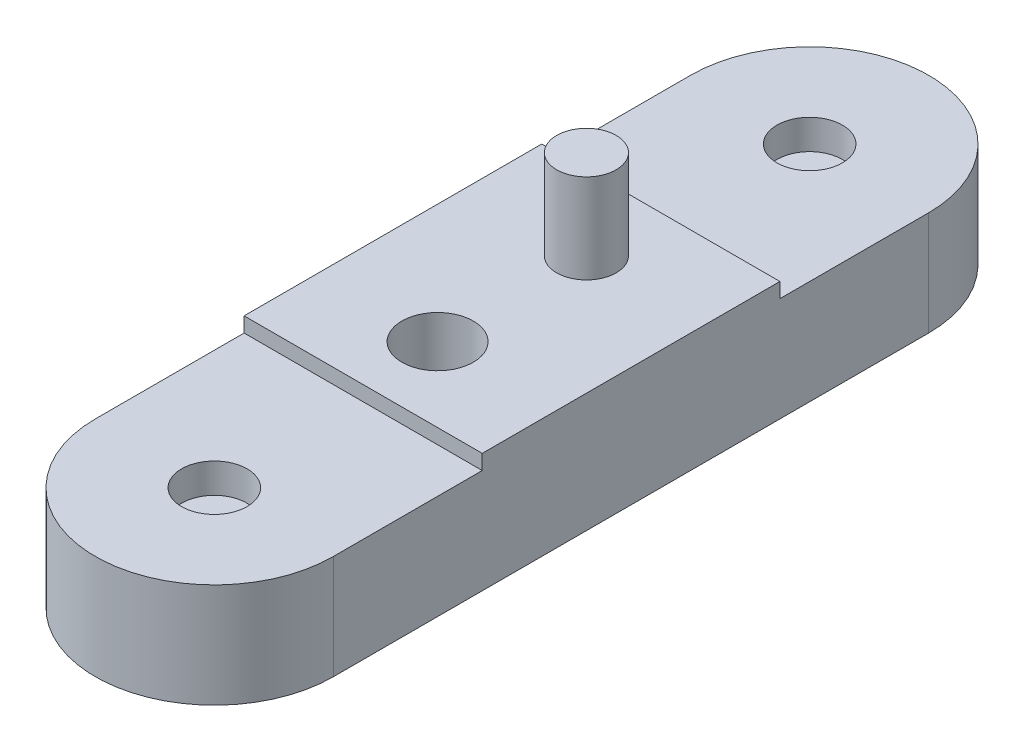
ISO-10303-21;
HEADER;
FILE_DESCRIPTION(('STEP AP214'),'2;1');
FILE_NAME('part.step','',(''),(''),'','','');
FILE_SCHEMA(('AUTOMOTIVE_DESIGN { 1 0 10303 214 1 1 1 1 }'));
ENDSEC;
DATA;
#1=APPLICATION_CONTEXT('core data for automotive mechanical design processes');
#2=APPLICATION_PROTOCOL_DEFINITION('international standard','automotive_design',2000,#1);
#3=PRODUCT_CONTEXT('',#1,'mechanical');
#4=PRODUCT('Part','Part','',(#3));
#5=PRODUCT_RELATED_PRODUCT_CATEGORY('part','',(#4));
#6=PRODUCT_DEFINITION_FORMATION('','',#4);
#7=PRODUCT_DEFINITION_CONTEXT('part definition',#1,'design');
#8=PRODUCT_DEFINITION('design','',#6,#7);
#9=PRODUCT_DEFINITION_SHAPE('','',#8);
#10=(LENGTH_UNIT() NAMED_UNIT(*) SI_UNIT(.MILLI.,.METRE.));
#11=(NAMED_UNIT(*) PLANE_ANGLE_UNIT() SI_UNIT($,.RADIAN.));
#12=(NAMED_UNIT(*) SI_UNIT($,.STERADIAN.) SOLID_ANGLE_UNIT());
#13=UNCERTAINTY_MEASURE_WITH_UNIT(LENGTH_MEASURE(1.E-05),#10,'distance_accuracy_value','');
#14=(GEOMETRIC_REPRESENTATION_CONTEXT(3) GLOBAL_UNCERTAINTY_ASSIGNED_CONTEXT((#13)) GLOBAL_UNIT_ASSIGNED_CONTEXT((#10,
#11,#12)) REPRESENTATION_CONTEXT('',''));
#15=CARTESIAN_POINT('',(0.,0.,0.));
#16=DIRECTION('',(0.,0.,1.));
#17=DIRECTION('',(1.,0.,0.));
#18=AXIS2_PLACEMENT_3D('',#15,#16,#17);
#19=CARTESIAN_POINT('',(0.,4.,0.));
#20=DIRECTION('',(0.,-1.,0.));
#21=DIRECTION('',(0.,0.,-1.));
#22=AXIS2_PLACEMENT_3D('',#19,#20,#21);
#23=CYLINDRICAL_SURFACE('',#22,4.);
#24=CARTESIAN_POINT('',(0.,3.5,0.));
#25=DIRECTION('',(0.,1.,0.));
#26=DIRECTION('',(0.,0.,1.));
#27=AXIS2_PLACEMENT_3D('',#24,#25,#26);
#28=CIRCLE('',#27,4.);
#29=CARTESIAN_POINT('',(4.,3.5,0.));
#30=VERTEX_POINT('',#29);
#31=CARTESIAN_POINT('',(-4.,3.5,0.));
#32=VERTEX_POINT('',#31);
#33=EDGE_CURVE('E157',#30,#32,#28,.T.);
#34=ORIENTED_EDGE('',*,*,#33,.F.);
#35=DIRECTION('',(0.,-1.,0.));
#36=VECTOR('',#35,1.);
#37=CARTESIAN_POINT('',(4.,4.,0.));
#38=LINE('',#37,#36);
#39=CARTESIAN_POINT('',(4.,0.,0.));
#40=VERTEX_POINT('',#39);
#41=EDGE_CURVE('E42',#30,#40,#38,.T.);
#42=ORIENTED_EDGE('',*,*,#41,.T.);
#43=CARTESIAN_POINT('',(0.,0.,0.));
#44=DIRECTION('',(0.,1.,0.));
#45=DIRECTION('',(0.,0.,1.));
#46=AXIS2_PLACEMENT_3D('',#43,#44,#45);
#47=CIRCLE('',#46,4.);
#48=CARTESIAN_POINT('',(-4.,0.,0.));
#49=VERTEX_POINT('',#48);
#50=EDGE_CURVE('E163',#40,#49,#47,.T.);
#51=ORIENTED_EDGE('',*,*,#50,.T.);
#52=DIRECTION('',(0.,-1.,0.));
#53=VECTOR('',#52,1.);
#54=CARTESIAN_POINT('',(-4.,4.,0.));
#55=LINE('',#54,#53);
#56=EDGE_CURVE('E11',#32,#49,#55,.T.);
#57=ORIENTED_EDGE('',*,*,#56,.F.);
#58=EDGE_LOOP('',(#34,#42,#51,#57));
#59=FACE_BOUND('',#58,.T.);
#60=ADVANCED_FACE('F35',(#59),#23,.T.);
#61=CARTESIAN_POINT('',(-4.,4.,0.));
#62=DIRECTION('',(1.,0.,0.));
#63=DIRECTION('',(0.,0.,-1.));
#64=AXIS2_PLACEMENT_3D('',#61,#62,#63);
#65=PLANE('',#64);
#66=DIRECTION('',(0.,0.,1.));
#67=VECTOR('',#66,1.);
#68=CARTESIAN_POINT('',(-4.,4.,0.));
#69=LINE('',#68,#67);
#70=CARTESIAN_POINT('',(-4.,4.,5.));
#71=VERTEX_POINT('',#70);
#72=CARTESIAN_POINT('',(-4.,4.,15.));
#73=VERTEX_POINT('',#72);
#74=EDGE_CURVE('E165',#71,#73,#69,.T.);
#75=ORIENTED_EDGE('',*,*,#74,.F.);
#76=DIRECTION('',(0.,1.,0.));
#77=VECTOR('',#76,1.);
#78=CARTESIAN_POINT('',(-4.,3.5,5.));
#79=LINE('',#78,#77);
#80=CARTESIAN_POINT('',(-4.,3.5,5.));
#81=VERTEX_POINT('',#80);
#82=EDGE_CURVE('E49',#81,#71,#79,.T.);
#83=ORIENTED_EDGE('',*,*,#82,.F.);
#84=DIRECTION('',(0.,0.,1.));
#85=VECTOR('',#84,1.);
#86=CARTESIAN_POINT('',(-4.,3.5,0.));
#87=LINE('',#86,#85);
#88=EDGE_CURVE('E149',#32,#81,#87,.T.);
#89=ORIENTED_EDGE('',*,*,#88,.F.);
#90=ORIENTED_EDGE('',*,*,#56,.T.);
#91=DIRECTION('',(0.,0.,1.));
#92=VECTOR('',#91,1.);
#93=CARTESIAN_POINT('',(-4.,0.,0.));
#94=LINE('',#93,#92);
#95=CARTESIAN_POINT('',(-4.,0.,20.));
#96=VERTEX_POINT('',#95);
#97=EDGE_CURVE('E172',#49,#96,#94,.T.);
#98=ORIENTED_EDGE('',*,*,#97,.T.);
#99=DIRECTION('',(0.,-1.,0.));
#100=VECTOR('',#99,1.);
#101=CARTESIAN_POINT('',(-4.,4.,20.));
#102=LINE('',#101,#100);
#103=CARTESIAN_POINT('',(-4.,3.5,20.));
#104=VERTEX_POINT('',#103);
#105=EDGE_CURVE('E123',#104,#96,#102,.T.);
#106=ORIENTED_EDGE('',*,*,#105,.F.);
#107=DIRECTION('',(0.,0.,-1.));
#108=VECTOR('',#107,1.);
#109=CARTESIAN_POINT('',(-4.,3.5,20.));
#110=LINE('',#109,#108);
#111=CARTESIAN_POINT('',(-4.,3.5,15.));
#112=VERTEX_POINT('',#111);
#113=EDGE_CURVE('E103',#104,#112,#110,.T.);
#114=ORIENTED_EDGE('',*,*,#113,.T.);
#115=DIRECTION('',(0.,1.,0.));
#116=VECTOR('',#115,1.);
#117=CARTESIAN_POINT('',(-4.,3.5,15.));
#118=LINE('',#117,#116);
#119=EDGE_CURVE('E112',#112,#73,#118,.T.);
#120=ORIENTED_EDGE('',*,*,#119,.T.);
#121=EDGE_LOOP('',(#75,#83,#89,#90,#98,#106,#114,#120));
#122=FACE_BOUND('',#121,.T.);
#123=ADVANCED_FACE('F121',(#122),#65,.F.);
#124=CARTESIAN_POINT('',(4.,4.,0.));
#125=DIRECTION('',(-1.,0.,0.));
#126=DIRECTION('',(0.,0.,1.));
#127=AXIS2_PLACEMENT_3D('',#124,#125,#126);
#128=PLANE('',#127);
#129=DIRECTION('',(0.,0.,-1.));
#130=VECTOR('',#129,1.);
#131=CARTESIAN_POINT('',(4.,3.5,0.));
#132=LINE('',#131,#130);
#133=CARTESIAN_POINT('',(4.,3.5,5.));
#134=VERTEX_POINT('',#133);
#135=EDGE_CURVE('E155',#134,#30,#132,.T.);
#136=ORIENTED_EDGE('',*,*,#135,.F.);
#137=DIRECTION('',(0.,1.,0.));
#138=VECTOR('',#137,1.);
#139=CARTESIAN_POINT('',(4.,3.5,5.));
#140=LINE('',#139,#138);
#141=CARTESIAN_POINT('',(4.,4.,5.));
#142=VERTEX_POINT('',#141);
#143=EDGE_CURVE('E160',#134,#142,#140,.T.);
#144=ORIENTED_EDGE('',*,*,#143,.T.);
#145=DIRECTION('',(0.,0.,-1.));
#146=VECTOR('',#145,1.);
#147=CARTESIAN_POINT('',(4.,4.,0.));
#148=LINE('',#147,#146);
#149=CARTESIAN_POINT('',(4.,4.,15.));
#150=VERTEX_POINT('',#149);
#151=EDGE_CURVE('E167',#150,#142,#148,.T.);
#152=ORIENTED_EDGE('',*,*,#151,.F.);
#153=DIRECTION('',(0.,1.,0.));
#154=VECTOR('',#153,1.);
#155=CARTESIAN_POINT('',(4.,3.5,15.));
#156=LINE('',#155,#154);
#157=CARTESIAN_POINT('',(4.,3.5,15.));
#158=VERTEX_POINT('',#157);
#159=EDGE_CURVE('E118',#158,#150,#156,.T.);
#160=ORIENTED_EDGE('',*,*,#159,.F.);
#161=DIRECTION('',(0.,0.,1.));
#162=VECTOR('',#161,1.);
#163=CARTESIAN_POINT('',(4.,3.5,20.));
#164=LINE('',#163,#162);
#165=CARTESIAN_POINT('',(4.,3.5,20.));
#166=VERTEX_POINT('',#165);
#167=EDGE_CURVE('E105',#158,#166,#164,.T.);
#168=ORIENTED_EDGE('',*,*,#167,.T.);
#169=DIRECTION('',(0.,-1.,0.));
#170=VECTOR('',#169,1.);
#171=CARTESIAN_POINT('',(4.,4.,20.));
#172=LINE('',#171,#170);
#173=CARTESIAN_POINT('',(4.,0.,20.));
#174=VERTEX_POINT('',#173);
#175=EDGE_CURVE('E138',#166,#174,#172,.T.);
#176=ORIENTED_EDGE('',*,*,#175,.T.);
#177=DIRECTION('',(0.,0.,-1.));
#178=VECTOR('',#177,1.);
#179=CARTESIAN_POINT('',(4.,0.,0.));
#180=LINE('',#179,#178);
#181=EDGE_CURVE('E168',#174,#40,#180,.T.);
#182=ORIENTED_EDGE('',*,*,#181,.T.);
#183=ORIENTED_EDGE('',*,*,#41,.F.);
#184=EDGE_LOOP('',(#136,#144,#152,#160,#168,#176,#182,#183));
#185=FACE_BOUND('',#184,.T.);
#186=ADVANCED_FACE('F177',(#185),#128,.F.);
#187=CARTESIAN_POINT('',(0.,4.,0.));
#188=DIRECTION('',(0.,1.,0.));
#189=DIRECTION('',(0.,0.,1.));
#190=AXIS2_PLACEMENT_3D('',#187,#188,#189);
#191=PLANE('',#190);
#192=CARTESIAN_POINT('',(0.,4.,12.5));
#193=DIRECTION('',(0.,1.,0.));
#194=DIRECTION('',(0.,0.,1.));
#195=AXIS2_PLACEMENT_3D('',#192,#193,#194);
#196=CIRCLE('',#195,1.2);
#197=CARTESIAN_POINT('',(0.,4.,13.7));
#198=VERTEX_POINT('',#197);
#199=EDGE_CURVE('E348',#198,#198,#196,.T.);
#200=ORIENTED_EDGE('',*,*,#199,.F.);
#201=EDGE_LOOP('',(#200));
#202=FACE_BOUND('',#201,.T.);
#203=CARTESIAN_POINT('',(0.,4.,7.5));
#204=DIRECTION('',(0.,1.,0.));
#205=DIRECTION('',(0.,0.,1.));
#206=AXIS2_PLACEMENT_3D('',#203,#204,#205);
#207=CIRCLE('',#206,1.);
#208=CARTESIAN_POINT('',(0.,4.,8.5));
#209=VERTEX_POINT('',#208);
#210=EDGE_CURVE('E350',#209,#209,#207,.T.);
#211=ORIENTED_EDGE('',*,*,#210,.F.);
#212=EDGE_LOOP('',(#211));
#213=FACE_BOUND('',#212,.T.);
#214=DIRECTION('',(1.,0.,0.));
#215=VECTOR('',#214,1.);
#216=CARTESIAN_POINT('',(-4.,4.,5.));
#217=LINE('',#216,#215);
#218=EDGE_CURVE('E146',#71,#142,#217,.T.);
#219=ORIENTED_EDGE('',*,*,#218,.F.);
#220=ORIENTED_EDGE('',*,*,#74,.T.);
#221=DIRECTION('',(1.,0.,0.));
#222=VECTOR('',#221,1.);
#223=CARTESIAN_POINT('',(-4.,4.,15.));
#224=LINE('',#223,#222);
#225=EDGE_CURVE('E115',#73,#150,#224,.T.);
#226=ORIENTED_EDGE('',*,*,#225,.T.);
#227=ORIENTED_EDGE('',*,*,#151,.T.);
#228=EDGE_LOOP('',(#219,#220,#226,#227));
#229=FACE_BOUND('',#228,.T.);
#230=ADVANCED_FACE('F188',(#202,#213,#229),#191,.T.);
#231=CARTESIAN_POINT('',(0.,0.,0.));
#232=DIRECTION('',(0.,1.,0.));
#233=DIRECTION('',(0.,0.,1.));
#234=AXIS2_PLACEMENT_3D('',#231,#232,#233);
#235=PLANE('',#234);
#236=CARTESIAN_POINT('',(0.,0.,12.5));
#237=DIRECTION('',(0.,1.,0.));
#238=DIRECTION('',(0.,0.,1.));
#239=AXIS2_PLACEMENT_3D('',#236,#237,#238);
#240=CIRCLE('',#239,1.2);
#241=CARTESIAN_POINT('',(0.,0.,13.7));
#242=VERTEX_POINT('',#241);
#243=EDGE_CURVE('E345',#242,#242,#240,.T.);
#244=ORIENTED_EDGE('',*,*,#243,.T.);
#245=EDGE_LOOP('',(#244));
#246=FACE_BOUND('',#245,.T.);
#247=ORIENTED_EDGE('',*,*,#50,.F.);
#248=ORIENTED_EDGE('',*,*,#181,.F.);
#249=CARTESIAN_POINT('',(0.,0.,20.));
#250=DIRECTION('',(0.,-1.,0.));
#251=DIRECTION('',(0.,0.,-1.));
#252=AXIS2_PLACEMENT_3D('',#249,#250,#251);
#253=CIRCLE('',#252,4.);
#254=EDGE_CURVE('E134',#174,#96,#253,.T.);
#255=ORIENTED_EDGE('',*,*,#254,.T.);
#256=ORIENTED_EDGE('',*,*,#97,.F.);
#257=EDGE_LOOP('',(#247,#248,#255,#256));
#258=FACE_BOUND('',#257,.T.);
#259=ADVANCED_FACE('F182',(#246,#258),#235,.F.);
#260=CARTESIAN_POINT('',(-4.,3.5,5.));
#261=DIRECTION('',(0.,0.,1.));
#262=DIRECTION('',(1.,0.,0.));
#263=AXIS2_PLACEMENT_3D('',#260,#261,#262);
#264=PLANE('',#263);
#265=ORIENTED_EDGE('',*,*,#218,.T.);
#266=ORIENTED_EDGE('',*,*,#143,.F.);
#267=DIRECTION('',(1.,0.,0.));
#268=VECTOR('',#267,1.);
#269=CARTESIAN_POINT('',(-4.,3.5,5.));
#270=LINE('',#269,#268);
#271=EDGE_CURVE('E152',#81,#134,#270,.T.);
#272=ORIENTED_EDGE('',*,*,#271,.F.);
#273=ORIENTED_EDGE('',*,*,#82,.T.);
#274=EDGE_LOOP('',(#265,#266,#272,#273));
#275=FACE_BOUND('',#274,.T.);
#276=ADVANCED_FACE('F213',(#275),#264,.F.);
#277=CARTESIAN_POINT('',(0.,3.5,0.));
#278=DIRECTION('',(0.,1.,0.));
#279=DIRECTION('',(0.,0.,1.));
#280=AXIS2_PLACEMENT_3D('',#277,#278,#279);
#281=PLANE('',#280);
#282=CARTESIAN_POINT('',(0.,3.5,0.));
#283=DIRECTION('',(0.,1.,0.));
#284=DIRECTION('',(0.,0.,1.));
#285=AXIS2_PLACEMENT_3D('',#282,#283,#284);
#286=CIRCLE('',#285,1.1);
#287=CARTESIAN_POINT('',(0.,3.5,1.1));
#288=VERTEX_POINT('',#287);
#289=EDGE_CURVE('E142',#288,#288,#286,.T.);
#290=ORIENTED_EDGE('',*,*,#289,.F.);
#291=EDGE_LOOP('',(#290));
#292=FACE_BOUND('',#291,.T.);
#293=ORIENTED_EDGE('',*,*,#88,.T.);
#294=ORIENTED_EDGE('',*,*,#271,.T.);
#295=ORIENTED_EDGE('',*,*,#135,.T.);
#296=ORIENTED_EDGE('',*,*,#33,.T.);
#297=EDGE_LOOP('',(#293,#294,#295,#296));
#298=FACE_BOUND('',#297,.T.);
#299=ADVANCED_FACE('F186',(#292,#298),#281,.T.);
#300=CARTESIAN_POINT('',(0.,2.5,0.));
#301=DIRECTION('',(0.,1.,0.));
#302=DIRECTION('',(0.,0.,1.));
#303=AXIS2_PLACEMENT_3D('',#300,#301,#302);
#304=CYLINDRICAL_SURFACE('',#303,1.1);
#305=CARTESIAN_POINT('',(0.,2.5,0.));
#306=DIRECTION('',(0.,1.,0.));
#307=DIRECTION('',(0.,0.,1.));
#308=AXIS2_PLACEMENT_3D('',#305,#306,#307);
#309=CIRCLE('',#308,1.1);
#310=CARTESIAN_POINT('',(0.,2.5,1.1));
#311=VERTEX_POINT('',#310);
#312=EDGE_CURVE('E143',#311,#311,#309,.T.);
#313=ORIENTED_EDGE('',*,*,#312,.F.);
#314=EDGE_LOOP('',(#313));
#315=FACE_BOUND('',#314,.T.);
#316=ORIENTED_EDGE('',*,*,#289,.T.);
#317=EDGE_LOOP('',(#316));
#318=FACE_BOUND('',#317,.T.);
#319=ADVANCED_FACE('F199',(#315,#318),#304,.F.);
#320=CARTESIAN_POINT('',(0.,2.5,0.));
#321=DIRECTION('',(0.,1.,0.));
#322=DIRECTION('',(0.,0.,1.));
#323=AXIS2_PLACEMENT_3D('',#320,#321,#322);
#324=PLANE('',#323);
#325=ORIENTED_EDGE('',*,*,#312,.T.);
#326=EDGE_LOOP('',(#325));
#327=FACE_BOUND('',#326,.T.);
#328=ADVANCED_FACE('F192',(#327),#324,.T.);
#329=CARTESIAN_POINT('',(0.,4.,20.));
#330=DIRECTION('',(0.,-1.,0.));
#331=DIRECTION('',(0.,0.,1.));
#332=AXIS2_PLACEMENT_3D('',#329,#330,#331);
#333=CYLINDRICAL_SURFACE('',#332,4.);
#334=CARTESIAN_POINT('',(0.,3.5,20.));
#335=DIRECTION('',(0.,-1.,0.));
#336=DIRECTION('',(0.,0.,-1.));
#337=AXIS2_PLACEMENT_3D('',#334,#335,#336);
#338=CIRCLE('',#337,4.);
#339=EDGE_CURVE('E119',#166,#104,#338,.T.);
#340=ORIENTED_EDGE('',*,*,#339,.T.);
#341=ORIENTED_EDGE('',*,*,#105,.T.);
#342=ORIENTED_EDGE('',*,*,#254,.F.);
#343=ORIENTED_EDGE('',*,*,#175,.F.);
#344=EDGE_LOOP('',(#340,#341,#342,#343));
#345=FACE_BOUND('',#344,.T.);
#346=ADVANCED_FACE('F190',(#345),#333,.T.);
#347=CARTESIAN_POINT('',(-4.,3.5,15.));
#348=DIRECTION('',(0.,0.,-1.));
#349=DIRECTION('',(1.,0.,0.));
#350=AXIS2_PLACEMENT_3D('',#347,#348,#349);
#351=PLANE('',#350);
#352=ORIENTED_EDGE('',*,*,#225,.F.);
#353=ORIENTED_EDGE('',*,*,#119,.F.);
#354=DIRECTION('',(1.,0.,0.));
#355=VECTOR('',#354,1.);
#356=CARTESIAN_POINT('',(-4.,3.5,15.));
#357=LINE('',#356,#355);
#358=EDGE_CURVE('E98',#112,#158,#357,.T.);
#359=ORIENTED_EDGE('',*,*,#358,.T.);
#360=ORIENTED_EDGE('',*,*,#159,.T.);
#361=EDGE_LOOP('',(#352,#353,#359,#360));
#362=FACE_BOUND('',#361,.T.);
#363=ADVANCED_FACE('F113',(#362),#351,.F.);
#364=CARTESIAN_POINT('',(0.,3.5,20.));
#365=DIRECTION('',(0.,1.,0.));
#366=DIRECTION('',(0.,0.,-1.));
#367=AXIS2_PLACEMENT_3D('',#364,#365,#366);
#368=PLANE('',#367);
#369=CARTESIAN_POINT('',(0.,3.5,20.));
#370=DIRECTION('',(0.,-1.,0.));
#371=DIRECTION('',(0.,0.,-1.));
#372=AXIS2_PLACEMENT_3D('',#369,#370,#371);
#373=CIRCLE('',#372,1.1);
#374=CARTESIAN_POINT('',(0.,3.5,18.9));
#375=VERTEX_POINT('',#374);
#376=EDGE_CURVE('E129',#375,#375,#373,.T.);
#377=ORIENTED_EDGE('',*,*,#376,.T.);
#378=EDGE_LOOP('',(#377));
#379=FACE_BOUND('',#378,.T.);
#380=ORIENTED_EDGE('',*,*,#113,.F.);
#381=ORIENTED_EDGE('',*,*,#339,.F.);
#382=ORIENTED_EDGE('',*,*,#167,.F.);
#383=ORIENTED_EDGE('',*,*,#358,.F.);
#384=EDGE_LOOP('',(#380,#381,#382,#383));
#385=FACE_BOUND('',#384,.T.);
#386=ADVANCED_FACE('F100',(#379,#385),#368,.T.);
#387=CARTESIAN_POINT('',(0.,2.5,20.));
#388=DIRECTION('',(0.,1.,0.));
#389=DIRECTION('',(0.,0.,-1.));
#390=AXIS2_PLACEMENT_3D('',#387,#388,#389);
#391=CYLINDRICAL_SURFACE('',#390,1.1);
#392=CARTESIAN_POINT('',(0.,2.5,20.));
#393=DIRECTION('',(0.,-1.,0.));
#394=DIRECTION('',(0.,0.,-1.));
#395=AXIS2_PLACEMENT_3D('',#392,#393,#394);
#396=CIRCLE('',#395,1.1);
#397=CARTESIAN_POINT('',(0.,2.5,18.9));
#398=VERTEX_POINT('',#397);
#399=EDGE_CURVE('E126',#398,#398,#396,.T.);
#400=ORIENTED_EDGE('',*,*,#399,.T.);
#401=EDGE_LOOP('',(#400));
#402=FACE_BOUND('',#401,.T.);
#403=ORIENTED_EDGE('',*,*,#376,.F.);
#404=EDGE_LOOP('',(#403));
#405=FACE_BOUND('',#404,.T.);
#406=ADVANCED_FACE('F290',(#402,#405),#391,.F.);
#407=CARTESIAN_POINT('',(0.,2.5,20.));
#408=DIRECTION('',(0.,1.,0.));
#409=DIRECTION('',(0.,0.,-1.));
#410=AXIS2_PLACEMENT_3D('',#407,#408,#409);
#411=PLANE('',#410);
#412=ORIENTED_EDGE('',*,*,#399,.F.);
#413=EDGE_LOOP('',(#412));
#414=FACE_BOUND('',#413,.T.);
#415=ADVANCED_FACE('F299',(#414),#411,.T.);
#416=CARTESIAN_POINT('',(0.,7.,7.5));
#417=DIRECTION('',(0.,-1.,0.));
#418=DIRECTION('',(0.,0.,-1.));
#419=AXIS2_PLACEMENT_3D('',#416,#417,#418);
#420=CYLINDRICAL_SURFACE('',#419,1.);
#421=CARTESIAN_POINT('',(0.,7.,7.5));
#422=DIRECTION('',(0.,1.,0.));
#423=DIRECTION('',(0.,0.,1.));
#424=AXIS2_PLACEMENT_3D('',#421,#422,#423);
#425=CIRCLE('',#424,1.);
#426=CARTESIAN_POINT('',(0.,7.,8.5));
#427=VERTEX_POINT('',#426);
#428=EDGE_CURVE('E353',#427,#427,#425,.T.);
#429=ORIENTED_EDGE('',*,*,#428,.F.);
#430=EDGE_LOOP('',(#429));
#431=FACE_BOUND('',#430,.T.);
#432=ORIENTED_EDGE('',*,*,#210,.T.);
#433=EDGE_LOOP('',(#432));
#434=FACE_BOUND('',#433,.T.);
#435=ADVANCED_FACE('F308',(#431,#434),#420,.T.);
#436=CARTESIAN_POINT('',(0.,7.,7.5));
#437=DIRECTION('',(0.,1.,0.));
#438=DIRECTION('',(0.,0.,1.));
#439=AXIS2_PLACEMENT_3D('',#436,#437,#438);
#440=PLANE('',#439);
#441=ORIENTED_EDGE('',*,*,#428,.T.);
#442=EDGE_LOOP('',(#441));
#443=FACE_BOUND('',#442,.T.);
#444=ADVANCED_FACE('F317',(#443),#440,.T.);
#445=CARTESIAN_POINT('',(0.,0.,12.5));
#446=DIRECTION('',(0.,1.,0.));
#447=DIRECTION('',(0.,0.,1.));
#448=AXIS2_PLACEMENT_3D('',#445,#446,#447);
#449=CYLINDRICAL_SURFACE('',#448,1.2);
#450=ORIENTED_EDGE('',*,*,#243,.F.);
#451=EDGE_LOOP('',(#450));
#452=FACE_BOUND('',#451,.T.);
#453=ORIENTED_EDGE('',*,*,#199,.T.);
#454=EDGE_LOOP('',(#453));
#455=FACE_BOUND('',#454,.T.);
#456=ADVANCED_FACE('F325',(#452,#455),#449,.F.);
#457=CLOSED_SHELL('',(#60,#123,#186,#230,#259,#276,#299,#319,#328,#346,#363,#386,#406,#415,#435,
#444,#456));
#458=MANIFOLD_SOLID_BREP('B2',#457);
#459=ADVANCED_BREP_SHAPE_REPRESENTATION('',(#18,#458),#14);
#460=SHAPE_DEFINITION_REPRESENTATION(#9,#459);
ENDSEC;
END-ISO-10303-21;
